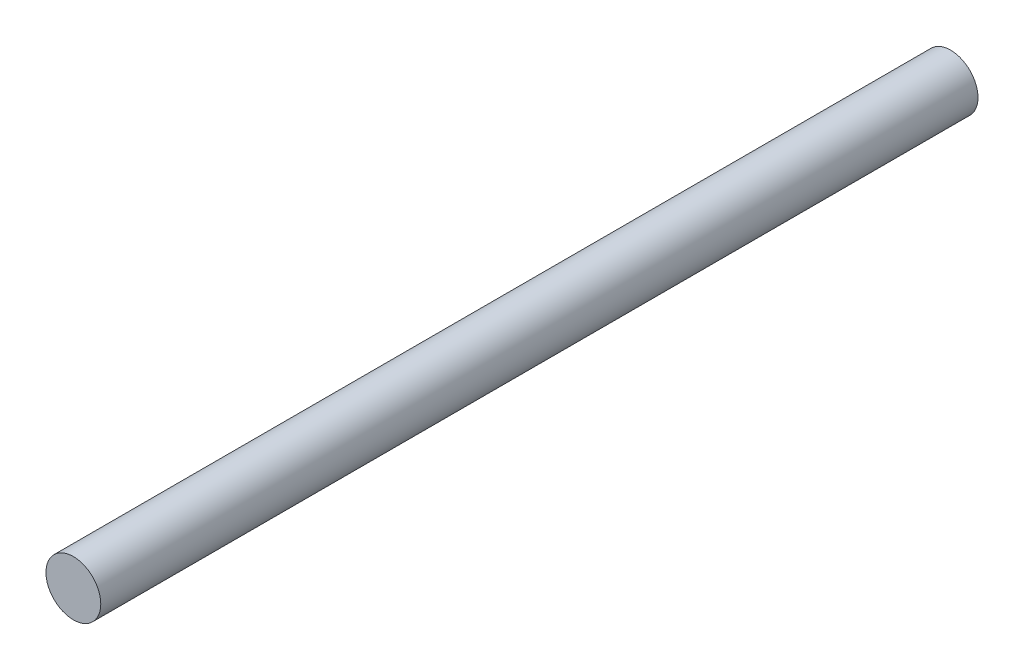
ISO-10303-21;
HEADER;
FILE_DESCRIPTION(('STEP AP214'),'2;1');
FILE_NAME('part.step','',(''),(''),'','','');
FILE_SCHEMA(('AUTOMOTIVE_DESIGN { 1 0 10303 214 1 1 1 1 }'));
ENDSEC;
DATA;
#1=APPLICATION_CONTEXT('core data for automotive mechanical design processes');
#2=APPLICATION_PROTOCOL_DEFINITION('international standard','automotive_design',2000,#1);
#3=PRODUCT_CONTEXT('',#1,'mechanical');
#4=PRODUCT('Part','Part','',(#3));
#5=PRODUCT_RELATED_PRODUCT_CATEGORY('part','',(#4));
#6=PRODUCT_DEFINITION_FORMATION('','',#4);
#7=PRODUCT_DEFINITION_CONTEXT('part definition',#1,'design');
#8=PRODUCT_DEFINITION('design','',#6,#7);
#9=PRODUCT_DEFINITION_SHAPE('','',#8);
#10=(LENGTH_UNIT() NAMED_UNIT(*) SI_UNIT(.MILLI.,.METRE.));
#11=(NAMED_UNIT(*) PLANE_ANGLE_UNIT() SI_UNIT($,.RADIAN.));
#12=(NAMED_UNIT(*) SI_UNIT($,.STERADIAN.) SOLID_ANGLE_UNIT());
#13=UNCERTAINTY_MEASURE_WITH_UNIT(LENGTH_MEASURE(1.E-05),#10,'distance_accuracy_value','');
#14=(GEOMETRIC_REPRESENTATION_CONTEXT(3) GLOBAL_UNCERTAINTY_ASSIGNED_CONTEXT((#13)) GLOBAL_UNIT_ASSIGNED_CONTEXT((#10,
#11,#12)) REPRESENTATION_CONTEXT('',''));
#15=CARTESIAN_POINT('',(0.,0.,0.));
#16=DIRECTION('',(0.,0.,1.));
#17=DIRECTION('',(1.,0.,0.));
#18=AXIS2_PLACEMENT_3D('',#15,#16,#17);
#19=CARTESIAN_POINT('',(0.,0.,16.));
#20=DIRECTION('',(0.,0.,-1.));
#21=DIRECTION('',(-1.,0.,0.));
#22=AXIS2_PLACEMENT_3D('',#19,#20,#21);
#23=CYLINDRICAL_SURFACE('',#22,0.5);
#24=CARTESIAN_POINT('',(0.,0.,16.));
#25=DIRECTION('',(0.,0.,1.));
#26=DIRECTION('',(1.,0.,0.));
#27=AXIS2_PLACEMENT_3D('',#24,#25,#26);
#28=CIRCLE('',#27,0.5);
#29=CARTESIAN_POINT('',(0.5,0.,16.));
#30=VERTEX_POINT('',#29);
#31=EDGE_CURVE('E10',#30,#30,#28,.T.);
#32=ORIENTED_EDGE('',*,*,#31,.F.);
#33=EDGE_LOOP('',(#32));
#34=FACE_BOUND('',#33,.T.);
#35=CARTESIAN_POINT('',(0.,0.,0.));
#36=DIRECTION('',(0.,0.,1.));
#37=DIRECTION('',(1.,0.,0.));
#38=AXIS2_PLACEMENT_3D('',#35,#36,#37);
#39=CIRCLE('',#38,0.5);
#40=CARTESIAN_POINT('',(0.5,0.,0.));
#41=VERTEX_POINT('',#40);
#42=EDGE_CURVE('E34',#41,#41,#39,.T.);
#43=ORIENTED_EDGE('',*,*,#42,.T.);
#44=EDGE_LOOP('',(#43));
#45=FACE_BOUND('',#44,.T.);
#46=ADVANCED_FACE('F31',(#34,#45),#23,.T.);
#47=CARTESIAN_POINT('',(0.,0.,16.));
#48=DIRECTION('',(0.,0.,1.));
#49=DIRECTION('',(1.,0.,0.));
#50=AXIS2_PLACEMENT_3D('',#47,#48,#49);
#51=PLANE('',#50);
#52=ORIENTED_EDGE('',*,*,#31,.T.);
#53=EDGE_LOOP('',(#52));
#54=FACE_BOUND('',#53,.T.);
#55=ADVANCED_FACE('F46',(#54),#51,.T.);
#56=CARTESIAN_POINT('',(0.,0.,0.));
#57=DIRECTION('',(0.,0.,1.));
#58=DIRECTION('',(1.,0.,0.));
#59=AXIS2_PLACEMENT_3D('',#56,#57,#58);
#60=PLANE('',#59);
#61=ORIENTED_EDGE('',*,*,#42,.F.);
#62=EDGE_LOOP('',(#61));
#63=FACE_BOUND('',#62,.T.);
#64=ADVANCED_FACE('F44',(#63),#60,.F.);
#65=CLOSED_SHELL('',(#46,#55,#64));
#66=MANIFOLD_SOLID_BREP('B2',#65);
#67=ADVANCED_BREP_SHAPE_REPRESENTATION('',(#18,#66),#14);
#68=SHAPE_DEFINITION_REPRESENTATION(#9,#67);
ENDSEC;
END-ISO-10303-21;
